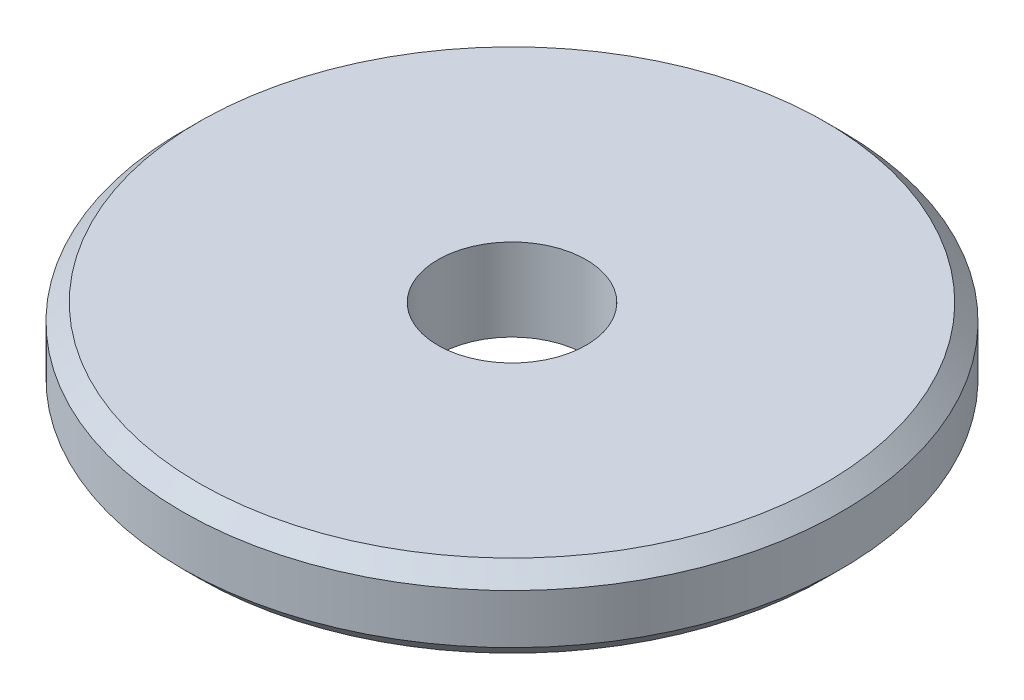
ISO-10303-21;
HEADER;
FILE_DESCRIPTION(('STEP AP214'),'2;1');
FILE_NAME('part.step','',(''),(''),'','','');
FILE_SCHEMA(('AUTOMOTIVE_DESIGN { 1 0 10303 214 1 1 1 1 }'));
ENDSEC;
DATA;
#1=APPLICATION_CONTEXT('core data for automotive mechanical design processes');
#2=APPLICATION_PROTOCOL_DEFINITION('international standard','automotive_design',2000,#1);
#3=PRODUCT_CONTEXT('',#1,'mechanical');
#4=PRODUCT('Part','Part','',(#3));
#5=PRODUCT_RELATED_PRODUCT_CATEGORY('part','',(#4));
#6=PRODUCT_DEFINITION_FORMATION('','',#4);
#7=PRODUCT_DEFINITION_CONTEXT('part definition',#1,'design');
#8=PRODUCT_DEFINITION('design','',#6,#7);
#9=PRODUCT_DEFINITION_SHAPE('','',#8);
#10=(LENGTH_UNIT() NAMED_UNIT(*) SI_UNIT(.MILLI.,.METRE.));
#11=(NAMED_UNIT(*) PLANE_ANGLE_UNIT() SI_UNIT($,.RADIAN.));
#12=(NAMED_UNIT(*) SI_UNIT($,.STERADIAN.) SOLID_ANGLE_UNIT());
#13=UNCERTAINTY_MEASURE_WITH_UNIT(LENGTH_MEASURE(1.E-05),#10,'distance_accuracy_value','');
#14=(GEOMETRIC_REPRESENTATION_CONTEXT(3) GLOBAL_UNCERTAINTY_ASSIGNED_CONTEXT((#13)) GLOBAL_UNIT_ASSIGNED_CONTEXT((#10,
#11,#12)) REPRESENTATION_CONTEXT('',''));
#15=CARTESIAN_POINT('',(0.,0.,0.));
#16=DIRECTION('',(0.,0.,1.));
#17=DIRECTION('',(1.,0.,0.));
#18=AXIS2_PLACEMENT_3D('',#15,#16,#17);
#19=CARTESIAN_POINT('',(0.,5.,0.));
#20=DIRECTION('',(0.,1.,0.));
#21=DIRECTION('',(0.,0.,1.));
#22=AXIS2_PLACEMENT_3D('',#19,#20,#21);
#23=PLANE('',#22);
#24=CARTESIAN_POINT('',(0.,5.,0.));
#25=DIRECTION('',(0.,1.,0.));
#26=DIRECTION('',(0.,0.,1.));
#27=AXIS2_PLACEMENT_3D('',#24,#25,#26);
#28=CIRCLE('',#27,19.);
#29=CARTESIAN_POINT('',(0.,5.,19.));
#30=VERTEX_POINT('',#29);
#31=EDGE_CURVE('E10',#30,#30,#28,.T.);
#32=ORIENTED_EDGE('',*,*,#31,.T.);
#33=EDGE_LOOP('',(#32));
#34=FACE_BOUND('',#33,.T.);
#35=CARTESIAN_POINT('',(0.,5.,0.));
#36=DIRECTION('',(0.,1.,0.));
#37=DIRECTION('',(0.,0.,1.));
#38=AXIS2_PLACEMENT_3D('',#35,#36,#37);
#39=CIRCLE('',#38,4.5);
#40=CARTESIAN_POINT('',(0.,5.,4.5));
#41=VERTEX_POINT('',#40);
#42=EDGE_CURVE('E49',#41,#41,#39,.T.);
#43=ORIENTED_EDGE('',*,*,#42,.F.);
#44=EDGE_LOOP('',(#43));
#45=FACE_BOUND('',#44,.T.);
#46=ADVANCED_FACE('F29',(#34,#45),#23,.T.);
#47=CARTESIAN_POINT('',(0.,0.,0.));
#48=DIRECTION('',(0.,1.,0.));
#49=DIRECTION('',(0.,0.,1.));
#50=AXIS2_PLACEMENT_3D('',#47,#48,#49);
#51=PLANE('',#50);
#52=CARTESIAN_POINT('',(0.,0.,0.));
#53=DIRECTION('',(0.,1.,0.));
#54=DIRECTION('',(0.,0.,1.));
#55=AXIS2_PLACEMENT_3D('',#52,#53,#54);
#56=CIRCLE('',#55,19.);
#57=CARTESIAN_POINT('',(0.,0.,19.));
#58=VERTEX_POINT('',#57);
#59=EDGE_CURVE('E36',#58,#58,#56,.F.);
#60=ORIENTED_EDGE('',*,*,#59,.T.);
#61=EDGE_LOOP('',(#60));
#62=FACE_BOUND('',#61,.T.);
#63=CARTESIAN_POINT('',(0.,0.,0.));
#64=DIRECTION('',(0.,1.,0.));
#65=DIRECTION('',(0.,0.,1.));
#66=AXIS2_PLACEMENT_3D('',#63,#64,#65);
#67=CIRCLE('',#66,4.5);
#68=CARTESIAN_POINT('',(0.,0.,4.5));
#69=VERTEX_POINT('',#68);
#70=EDGE_CURVE('E50',#69,#69,#67,.T.);
#71=ORIENTED_EDGE('',*,*,#70,.T.);
#72=EDGE_LOOP('',(#71));
#73=FACE_BOUND('',#72,.T.);
#74=ADVANCED_FACE('F60',(#62,#73),#51,.F.);
#75=CARTESIAN_POINT('',(0.,5.,0.));
#76=DIRECTION('',(0.,-1.,0.));
#77=DIRECTION('',(0.,0.,-1.));
#78=AXIS2_PLACEMENT_3D('',#75,#76,#77);
#79=CYLINDRICAL_SURFACE('',#78,20.);
#80=CARTESIAN_POINT('',(0.,0.999999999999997,0.));
#81=DIRECTION('',(0.,1.,0.));
#82=DIRECTION('',(0.,0.,1.));
#83=AXIS2_PLACEMENT_3D('',#80,#81,#82);
#84=CIRCLE('',#83,20.);
#85=CARTESIAN_POINT('',(0.,0.999999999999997,20.));
#86=VERTEX_POINT('',#85);
#87=EDGE_CURVE('E40',#86,#86,#84,.T.);
#88=ORIENTED_EDGE('',*,*,#87,.T.);
#89=EDGE_LOOP('',(#88));
#90=FACE_BOUND('',#89,.T.);
#91=CARTESIAN_POINT('',(0.,4.,0.));
#92=DIRECTION('',(0.,1.,0.));
#93=DIRECTION('',(0.,0.,1.));
#94=AXIS2_PLACEMENT_3D('',#91,#92,#93);
#95=CIRCLE('',#94,20.);
#96=CARTESIAN_POINT('',(0.,4.,20.));
#97=VERTEX_POINT('',#96);
#98=EDGE_CURVE('E44',#97,#97,#95,.F.);
#99=ORIENTED_EDGE('',*,*,#98,.T.);
#100=EDGE_LOOP('',(#99));
#101=FACE_BOUND('',#100,.T.);
#102=ADVANCED_FACE('F65',(#90,#101),#79,.T.);
#103=CARTESIAN_POINT('',(0.,5.,0.));
#104=DIRECTION('',(0.,-1.,0.));
#105=DIRECTION('',(0.,0.,-1.));
#106=AXIS2_PLACEMENT_3D('',#103,#104,#105);
#107=CYLINDRICAL_SURFACE('',#106,4.5);
#108=ORIENTED_EDGE('',*,*,#42,.T.);
#109=EDGE_LOOP('',(#108));
#110=FACE_BOUND('',#109,.T.);
#111=ORIENTED_EDGE('',*,*,#70,.F.);
#112=EDGE_LOOP('',(#111));
#113=FACE_BOUND('',#112,.T.);
#114=ADVANCED_FACE('F56',(#110,#113),#107,.F.);
#115=CARTESIAN_POINT('',(0.,0.999999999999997,0.));
#116=DIRECTION('',(0.,1.,0.));
#117=DIRECTION('',(0.,0.,1.));
#118=AXIS2_PLACEMENT_3D('',#115,#116,#117);
#119=CONICAL_SURFACE('',#118,20.,0.78539816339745);
#120=ORIENTED_EDGE('',*,*,#59,.F.);
#121=EDGE_LOOP('',(#120));
#122=FACE_BOUND('',#121,.T.);
#123=ORIENTED_EDGE('',*,*,#87,.F.);
#124=EDGE_LOOP('',(#123));
#125=FACE_BOUND('',#124,.T.);
#126=ADVANCED_FACE('F71',(#122,#125),#119,.T.);
#127=CARTESIAN_POINT('',(0.,5.,0.));
#128=DIRECTION('',(0.,-1.,0.));
#129=DIRECTION('',(0.,0.,-1.));
#130=AXIS2_PLACEMENT_3D('',#127,#128,#129);
#131=CONICAL_SURFACE('',#130,19.,0.78539816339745);
#132=ORIENTED_EDGE('',*,*,#98,.F.);
#133=EDGE_LOOP('',(#132));
#134=FACE_BOUND('',#133,.T.);
#135=ORIENTED_EDGE('',*,*,#31,.F.);
#136=EDGE_LOOP('',(#135));
#137=FACE_BOUND('',#136,.T.);
#138=ADVANCED_FACE('F31',(#134,#137),#131,.T.);
#139=CLOSED_SHELL('',(#46,#74,#102,#114,#126,#138));
#140=MANIFOLD_SOLID_BREP('B2',#139);
#141=ADVANCED_BREP_SHAPE_REPRESENTATION('',(#18,#140),#14);
#142=SHAPE_DEFINITION_REPRESENTATION(#9,#141);
ENDSEC;
END-ISO-10303-21;
